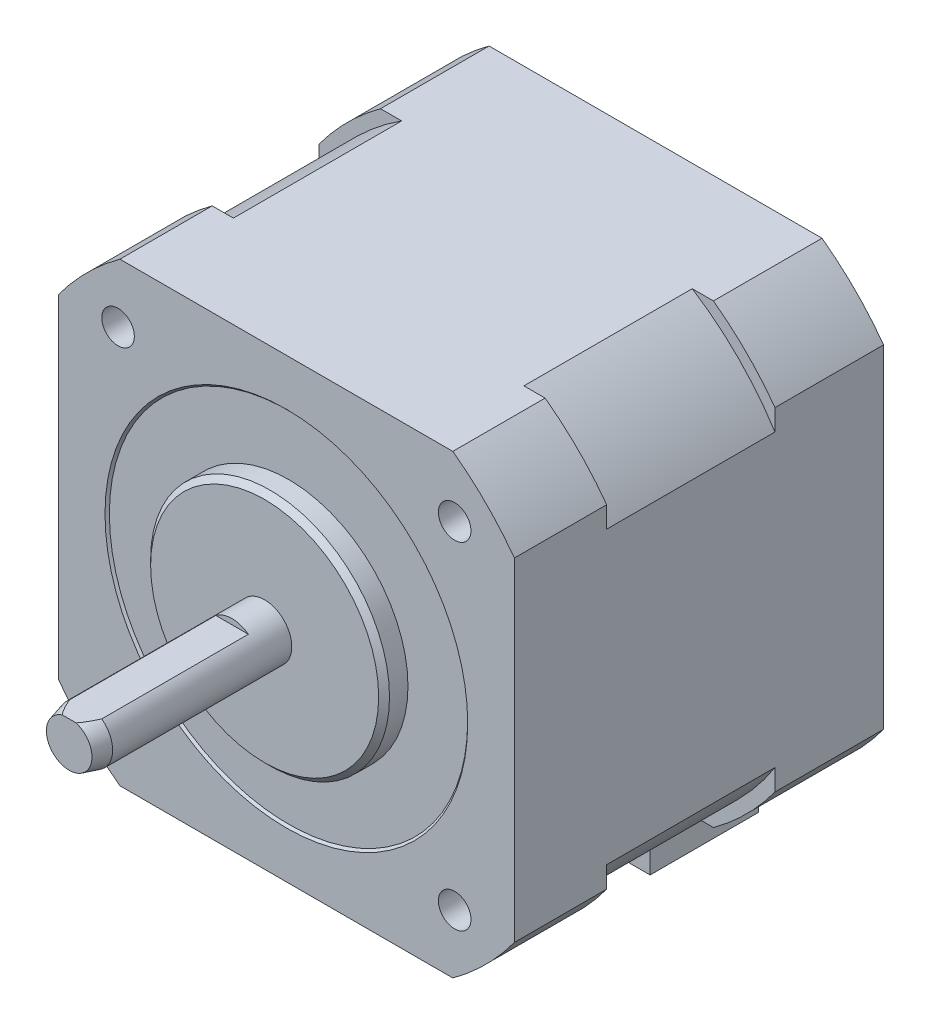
ISO-10303-21;
HEADER;
FILE_DESCRIPTION(('STEP AP214'),'2;1');
FILE_NAME('part.step','',(''),(''),'','','');
FILE_SCHEMA(('AUTOMOTIVE_DESIGN { 1 0 10303 214 1 1 1 1 }'));
ENDSEC;
DATA;
#1=APPLICATION_CONTEXT('core data for automotive mechanical design processes');
#2=APPLICATION_PROTOCOL_DEFINITION('international standard','automotive_design',2000,#1);
#3=PRODUCT_CONTEXT('',#1,'mechanical');
#4=PRODUCT('Part','Part','',(#3));
#5=PRODUCT_RELATED_PRODUCT_CATEGORY('part','',(#4));
#6=PRODUCT_DEFINITION_FORMATION('','',#4);
#7=PRODUCT_DEFINITION_CONTEXT('part definition',#1,'design');
#8=PRODUCT_DEFINITION('design','',#6,#7);
#9=PRODUCT_DEFINITION_SHAPE('','',#8);
#10=(LENGTH_UNIT() NAMED_UNIT(*) SI_UNIT(.MILLI.,.METRE.));
#11=(NAMED_UNIT(*) PLANE_ANGLE_UNIT() SI_UNIT($,.RADIAN.));
#12=(NAMED_UNIT(*) SI_UNIT($,.STERADIAN.) SOLID_ANGLE_UNIT());
#13=UNCERTAINTY_MEASURE_WITH_UNIT(LENGTH_MEASURE(1.E-05),#10,'distance_accuracy_value','');
#14=(GEOMETRIC_REPRESENTATION_CONTEXT(3) GLOBAL_UNCERTAINTY_ASSIGNED_CONTEXT((#13)) GLOBAL_UNIT_ASSIGNED_CONTEXT((#10,
#11,#12)) REPRESENTATION_CONTEXT('',''));
#15=CARTESIAN_POINT('',(0.,0.,0.));
#16=DIRECTION('',(0.,0.,1.));
#17=DIRECTION('',(1.,0.,0.));
#18=AXIS2_PLACEMENT_3D('',#15,#16,#17);
#19=CARTESIAN_POINT('',(21.,-21.,-10.5));
#20=DIRECTION('',(0.,1.,0.));
#21=DIRECTION('',(-1.,0.,0.));
#22=AXIS2_PLACEMENT_3D('',#19,#20,#21);
#23=PLANE('',#22);
#24=DIRECTION('',(0.,0.,-1.));
#25=VECTOR('',#24,1.);
#26=CARTESIAN_POINT('',(-9.5,-21.,-26.));
#27=LINE('',#26,#25);
#28=CARTESIAN_POINT('',(-9.5,-21.,-26.));
#29=VERTEX_POINT('',#28);
#30=CARTESIAN_POINT('',(-9.5,-21.0000000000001,-36.));
#31=VERTEX_POINT('',#30);
#32=EDGE_CURVE('E42',#29,#31,#27,.T.);
#33=ORIENTED_EDGE('',*,*,#32,.F.);
#34=DIRECTION('',(-1.,0.,0.));
#35=VECTOR('',#34,1.);
#36=CARTESIAN_POINT('',(-9.5,-21.,-26.));
#37=LINE('',#36,#35);
#38=CARTESIAN_POINT('',(9.5,-21.,-26.));
#39=VERTEX_POINT('',#38);
#40=EDGE_CURVE('E262',#39,#29,#37,.T.);
#41=ORIENTED_EDGE('',*,*,#40,.F.);
#42=DIRECTION('',(0.,0.,1.));
#43=VECTOR('',#42,1.);
#44=CARTESIAN_POINT('',(9.5,-21.,-26.));
#45=LINE('',#44,#43);
#46=CARTESIAN_POINT('',(9.5,-21.,-36.));
#47=VERTEX_POINT('',#46);
#48=EDGE_CURVE('E278',#47,#39,#45,.T.);
#49=ORIENTED_EDGE('',*,*,#48,.F.);
#50=DIRECTION('',(-1.,0.,0.));
#51=VECTOR('',#50,1.);
#52=CARTESIAN_POINT('',(15.3297097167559,-21.,-36.));
#53=LINE('',#52,#51);
#54=CARTESIAN_POINT('',(15.3297097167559,-21.,-36.));
#55=VERTEX_POINT('',#54);
#56=EDGE_CURVE('E283',#55,#47,#53,.T.);
#57=ORIENTED_EDGE('',*,*,#56,.F.);
#58=DIRECTION('',(0.,0.,1.));
#59=VECTOR('',#58,1.);
#60=CARTESIAN_POINT('',(15.3297097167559,-21.,-36.));
#61=LINE('',#60,#59);
#62=CARTESIAN_POINT('',(15.3297097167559,-21.,-26.));
#63=VERTEX_POINT('',#62);
#64=EDGE_CURVE('E356',#55,#63,#61,.T.);
#65=ORIENTED_EDGE('',*,*,#64,.T.);
#66=DIRECTION('',(-1.,0.,0.));
#67=VECTOR('',#66,1.);
#68=CARTESIAN_POINT('',(-13.3794618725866,-21.,-26.));
#69=LINE('',#68,#67);
#70=CARTESIAN_POINT('',(13.3794618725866,-21.,-26.));
#71=VERTEX_POINT('',#70);
#72=EDGE_CURVE('E317',#63,#71,#69,.T.);
#73=ORIENTED_EDGE('',*,*,#72,.T.);
#74=DIRECTION('',(0.,0.,1.));
#75=VECTOR('',#74,1.);
#76=CARTESIAN_POINT('',(13.3794618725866,-21.,-26.));
#77=LINE('',#76,#75);
#78=CARTESIAN_POINT('',(13.3794618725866,-21.,-10.5));
#79=VERTEX_POINT('',#78);
#80=EDGE_CURVE('E724',#71,#79,#77,.T.);
#81=ORIENTED_EDGE('',*,*,#80,.T.);
#82=DIRECTION('',(-1.,0.,0.));
#83=VECTOR('',#82,1.);
#84=CARTESIAN_POINT('',(21.,-21.,-10.5));
#85=LINE('',#84,#83);
#86=CARTESIAN_POINT('',(15.3297097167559,-21.,-10.5));
#87=VERTEX_POINT('',#86);
#88=EDGE_CURVE('E563',#87,#79,#85,.T.);
#89=ORIENTED_EDGE('',*,*,#88,.F.);
#90=DIRECTION('',(0.,0.,1.));
#91=VECTOR('',#90,1.);
#92=CARTESIAN_POINT('',(15.3297097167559,-21.,-36.));
#93=LINE('',#92,#91);
#94=CARTESIAN_POINT('',(15.3297097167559,-21.,-2.));
#95=VERTEX_POINT('',#94);
#96=EDGE_CURVE('E625',#95,#87,#93,.F.);
#97=ORIENTED_EDGE('',*,*,#96,.F.);
#98=DIRECTION('',(-1.,0.,0.));
#99=VECTOR('',#98,1.);
#100=CARTESIAN_POINT('',(21.,-21.,-2.));
#101=LINE('',#100,#99);
#102=CARTESIAN_POINT('',(-15.3297097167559,-21.,-2.));
#103=VERTEX_POINT('',#102);
#104=EDGE_CURVE('E571',#95,#103,#101,.T.);
#105=ORIENTED_EDGE('',*,*,#104,.T.);
#106=DIRECTION('',(0.,0.,1.));
#107=VECTOR('',#106,1.);
#108=CARTESIAN_POINT('',(-15.3297097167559,-21.,-36.));
#109=LINE('',#108,#107);
#110=CARTESIAN_POINT('',(-15.3297097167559,-21.,-10.5));
#111=VERTEX_POINT('',#110);
#112=EDGE_CURVE('E629',#111,#103,#109,.T.);
#113=ORIENTED_EDGE('',*,*,#112,.F.);
#114=CARTESIAN_POINT('',(-13.3794618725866,-21.,-10.5));
#115=VERTEX_POINT('',#114);
#116=EDGE_CURVE('E568',#115,#111,#85,.T.);
#117=ORIENTED_EDGE('',*,*,#116,.F.);
#118=DIRECTION('',(0.,0.,1.));
#119=VECTOR('',#118,1.);
#120=CARTESIAN_POINT('',(-13.3794618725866,-21.,-26.));
#121=LINE('',#120,#119);
#122=CARTESIAN_POINT('',(-13.3794618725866,-21.,-26.));
#123=VERTEX_POINT('',#122);
#124=EDGE_CURVE('E725',#123,#115,#121,.T.);
#125=ORIENTED_EDGE('',*,*,#124,.F.);
#126=CARTESIAN_POINT('',(-15.3297097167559,-21.,-26.));
#127=VERTEX_POINT('',#126);
#128=EDGE_CURVE('E315',#123,#127,#69,.T.);
#129=ORIENTED_EDGE('',*,*,#128,.T.);
#130=DIRECTION('',(0.,0.,1.));
#131=VECTOR('',#130,1.);
#132=CARTESIAN_POINT('',(-15.3297097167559,-21.,-36.));
#133=LINE('',#132,#131);
#134=CARTESIAN_POINT('',(-15.3297097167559,-21.,-36.));
#135=VERTEX_POINT('',#134);
#136=EDGE_CURVE('E353',#135,#127,#133,.T.);
#137=ORIENTED_EDGE('',*,*,#136,.F.);
#138=EDGE_CURVE('E60',#31,#135,#53,.T.);
#139=ORIENTED_EDGE('',*,*,#138,.F.);
#140=EDGE_LOOP('',(#33,#41,#49,#57,#65,#73,#81,#89,#97,#105,#113,#117,#125,#129,#137,#139));
#141=FACE_BOUND('',#140,.T.);
#142=ADVANCED_FACE('F38',(#141),#23,.F.);
#143=CARTESIAN_POINT('',(0.,0.,18.));
#144=DIRECTION('',(0.,0.,-1.));
#145=DIRECTION('',(-1.,0.,0.));
#146=AXIS2_PLACEMENT_3D('',#143,#144,#145);
#147=CYLINDRICAL_SURFACE('',#146,2.5);
#148=CARTESIAN_POINT('',(0.,0.,16.4999999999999));
#149=DIRECTION('',(0.,0.,1.));
#150=DIRECTION('',(1.,0.,0.));
#151=AXIS2_PLACEMENT_3D('',#148,#149,#150);
#152=CIRCLE('',#151,2.5);
#153=CARTESIAN_POINT('',(1.5,2.,16.4999999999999));
#154=VERTEX_POINT('',#153);
#155=CARTESIAN_POINT('',(-1.49999999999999,2.,16.4999999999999));
#156=VERTEX_POINT('',#155);
#157=EDGE_CURVE('E407',#154,#156,#152,.F.);
#158=ORIENTED_EDGE('',*,*,#157,.T.);
#159=DIRECTION('',(0.,0.,-1.));
#160=VECTOR('',#159,1.);
#161=CARTESIAN_POINT('',(-1.5,2.,18.));
#162=LINE('',#161,#160);
#163=CARTESIAN_POINT('',(-1.5,2.,3.));
#164=VERTEX_POINT('',#163);
#165=EDGE_CURVE('E303',#156,#164,#162,.T.);
#166=ORIENTED_EDGE('',*,*,#165,.T.);
#167=CARTESIAN_POINT('',(0.,0.,3.));
#168=DIRECTION('',(0.,0.,1.));
#169=DIRECTION('',(1.,0.,0.));
#170=AXIS2_PLACEMENT_3D('',#167,#168,#169);
#171=CIRCLE('',#170,2.5);
#172=CARTESIAN_POINT('',(1.5,2.,3.));
#173=VERTEX_POINT('',#172);
#174=EDGE_CURVE('E419',#173,#164,#171,.T.);
#175=ORIENTED_EDGE('',*,*,#174,.F.);
#176=DIRECTION('',(0.,0.,-1.));
#177=VECTOR('',#176,1.);
#178=CARTESIAN_POINT('',(1.5,2.,18.));
#179=LINE('',#178,#177);
#180=EDGE_CURVE('E756',#173,#154,#179,.F.);
#181=ORIENTED_EDGE('',*,*,#180,.T.);
#182=EDGE_LOOP('',(#158,#166,#175,#181));
#183=FACE_BOUND('',#182,.T.);
#184=CARTESIAN_POINT('',(0.,0.,0.));
#185=DIRECTION('',(0.,0.,-1.));
#186=DIRECTION('',(-1.,0.,0.));
#187=AXIS2_PLACEMENT_3D('',#184,#185,#186);
#188=CIRCLE('',#187,2.5);
#189=CARTESIAN_POINT('',(-2.5,0.,0.));
#190=VERTEX_POINT('',#189);
#191=EDGE_CURVE('E560',#190,#190,#188,.T.);
#192=ORIENTED_EDGE('',*,*,#191,.F.);
#193=EDGE_LOOP('',(#192));
#194=FACE_BOUND('',#193,.T.);
#195=ADVANCED_FACE('F528',(#183,#194),#147,.T.);
#196=CARTESIAN_POINT('',(0.,0.,18.));
#197=DIRECTION('',(0.,0.,1.));
#198=DIRECTION('',(1.,0.,0.));
#199=AXIS2_PLACEMENT_3D('',#196,#197,#198);
#200=PLANE('',#199);
#201=DIRECTION('',(1.,0.,0.));
#202=VECTOR('',#201,1.);
#203=CARTESIAN_POINT('',(-4.72781232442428,2.,18.));
#204=LINE('',#203,#202);
#205=CARTESIAN_POINT('',(-0.633974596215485,2.,18.));
#206=VERTEX_POINT('',#205);
#207=CARTESIAN_POINT('',(0.633974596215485,2.,18.));
#208=VERTEX_POINT('',#207);
#209=EDGE_CURVE('E759',#206,#208,#204,.T.);
#210=ORIENTED_EDGE('',*,*,#209,.F.);
#211=CARTESIAN_POINT('',(0.,0.,18.));
#212=DIRECTION('',(0.,0.,1.));
#213=DIRECTION('',(1.,0.,0.));
#214=AXIS2_PLACEMENT_3D('',#211,#212,#213);
#215=CIRCLE('',#214,2.09807621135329);
#216=EDGE_CURVE('E404',#206,#208,#215,.T.);
#217=ORIENTED_EDGE('',*,*,#216,.T.);
#218=EDGE_LOOP('',(#210,#217));
#219=FACE_BOUND('',#218,.T.);
#220=ADVANCED_FACE('F543',(#219),#200,.T.);
#221=CARTESIAN_POINT('',(0.,0.,0.));
#222=DIRECTION('',(0.,0.,-1.));
#223=DIRECTION('',(-1.,0.,0.));
#224=AXIS2_PLACEMENT_3D('',#221,#222,#223);
#225=PLANE('',#224);
#226=CARTESIAN_POINT('',(0.,0.,0.));
#227=DIRECTION('',(0.,0.,-1.));
#228=DIRECTION('',(-1.,0.,0.));
#229=AXIS2_PLACEMENT_3D('',#226,#227,#228);
#230=CIRCLE('',#229,10.5);
#231=CARTESIAN_POINT('',(-10.5,0.,0.));
#232=VERTEX_POINT('',#231);
#233=EDGE_CURVE('E48',#232,#232,#230,.F.);
#234=ORIENTED_EDGE('',*,*,#233,.T.);
#235=EDGE_LOOP('',(#234));
#236=FACE_BOUND('',#235,.T.);
#237=ORIENTED_EDGE('',*,*,#191,.T.);
#238=EDGE_LOOP('',(#237));
#239=FACE_BOUND('',#238,.T.);
#240=ADVANCED_FACE('F539',(#236,#239),#225,.F.);
#241=CARTESIAN_POINT('',(0.,0.,-2.));
#242=DIRECTION('',(0.,0.,1.));
#243=DIRECTION('',(1.,0.,0.));
#244=AXIS2_PLACEMENT_3D('',#241,#242,#243);
#245=CYLINDRICAL_SURFACE('',#244,11.);
#246=CARTESIAN_POINT('',(0.,0.,-0.500000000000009));
#247=DIRECTION('',(0.,0.,-1.));
#248=DIRECTION('',(-1.,0.,0.));
#249=AXIS2_PLACEMENT_3D('',#246,#247,#248);
#250=CIRCLE('',#249,11.);
#251=CARTESIAN_POINT('',(-11.,0.,-0.500000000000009));
#252=VERTEX_POINT('',#251);
#253=EDGE_CURVE('E825',#252,#252,#250,.T.);
#254=ORIENTED_EDGE('',*,*,#253,.T.);
#255=EDGE_LOOP('',(#254));
#256=FACE_BOUND('',#255,.T.);
#257=CARTESIAN_POINT('',(0.,0.,-2.2));
#258=DIRECTION('',(0.,0.,1.));
#259=DIRECTION('',(1.,0.,0.));
#260=AXIS2_PLACEMENT_3D('',#257,#258,#259);
#261=CIRCLE('',#260,11.);
#262=CARTESIAN_POINT('',(11.,0.,-2.2));
#263=VERTEX_POINT('',#262);
#264=EDGE_CURVE('E265',#263,#263,#261,.T.);
#265=ORIENTED_EDGE('',*,*,#264,.T.);
#266=EDGE_LOOP('',(#265));
#267=FACE_BOUND('',#266,.T.);
#268=ADVANCED_FACE('F542',(#256,#267),#245,.T.);
#269=CARTESIAN_POINT('',(0.,0.,18.));
#270=DIRECTION('',(0.,0.,-1.));
#271=DIRECTION('',(-1.,0.,0.));
#272=AXIS2_PLACEMENT_3D('',#269,#270,#271);
#273=CONICAL_SURFACE('',#272,2.09807621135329,0.261799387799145);
#274=CARTESIAN_POINT('',(-2.67411513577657,2.,13.3677080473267));
#275=CARTESIAN_POINT('',(-2.63311786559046,2.,13.4902257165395));
#276=CARTESIAN_POINT('',(-2.59182160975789,2.,13.6126436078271));
#277=CARTESIAN_POINT('',(-2.50853023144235,2.,13.8572444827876));
#278=CARTESIAN_POINT('',(-2.46653509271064,2.,13.9794274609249));
#279=CARTESIAN_POINT('',(-2.33928264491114,2.,14.34576464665));
#280=CARTESIAN_POINT('',(-2.25282589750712,2.,14.5895039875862));
#281=CARTESIAN_POINT('',(-2.07457613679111,2.,15.0781045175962));
#282=CARTESIAN_POINT('',(-1.98273458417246,2.,15.3229481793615));
#283=CARTESIAN_POINT('',(-1.84011140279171,2.,15.688262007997));
#284=CARTESIAN_POINT('',(-1.79177038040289,2.,15.8096838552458));
#285=CARTESIAN_POINT('',(-1.6930545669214,2.,16.0516959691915));
#286=CARTESIAN_POINT('',(-1.64267985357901,2.,16.1722862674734));
#287=CARTESIAN_POINT('',(-1.53950262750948,2.,16.4120087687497));
#288=CARTESIAN_POINT('',(-1.4867076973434,2.,16.5311442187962));
#289=CARTESIAN_POINT('',(-1.37773401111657,2.,16.7679408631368));
#290=CARTESIAN_POINT('',(-1.32155357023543,2.,16.8856012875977));
#291=CARTESIAN_POINT('',(-1.20458285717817,2.,17.1187131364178));
#292=CARTESIAN_POINT('',(-1.14379017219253,2.,17.2341633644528));
#293=CARTESIAN_POINT('',(-1.01570284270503,2.,17.4612984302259));
#294=CARTESIAN_POINT('',(-0.948415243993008,2.,17.5729871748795));
#295=CARTESIAN_POINT('',(-0.817363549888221,2.,17.7692701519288));
#296=CARTESIAN_POINT('',(-0.755348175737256,2.,17.8549879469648));
#297=CARTESIAN_POINT('',(-0.654778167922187,2.,17.9770588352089));
#298=CARTESIAN_POINT('',(-0.620094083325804,2.,18.0165731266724));
#299=CARTESIAN_POINT('',(-0.547506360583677,2.,18.092493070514));
#300=CARTESIAN_POINT('',(-0.509607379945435,2.,18.1289030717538));
#301=CARTESIAN_POINT('',(-0.439829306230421,2.,18.1884315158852));
#302=CARTESIAN_POINT('',(-0.408844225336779,2.,18.212585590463));
#303=CARTESIAN_POINT('',(-0.344218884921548,2.,18.2572111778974));
#304=CARTESIAN_POINT('',(-0.310575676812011,2.,18.2776785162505));
#305=CARTESIAN_POINT('',(-0.240012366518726,2.,18.3136158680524));
#306=CARTESIAN_POINT('',(-0.203051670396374,2.,18.3290087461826));
#307=CARTESIAN_POINT('',(-0.126881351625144,2.,18.3523462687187));
#308=CARTESIAN_POINT('',(-0.0876800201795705,2.,18.3603166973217));
#309=CARTESIAN_POINT('',(-0.0127311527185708,2.,18.367039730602));
#310=CARTESIAN_POINT('',(0.0229341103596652,2.,18.3666919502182));
#311=CARTESIAN_POINT('',(0.0935290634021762,2.,18.3590326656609));
#312=CARTESIAN_POINT('',(0.12845758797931,2.,18.3517108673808));
#313=CARTESIAN_POINT('',(0.201815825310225,2.,18.329553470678));
#314=CARTESIAN_POINT('',(0.239935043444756,2.,18.3137192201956));
#315=CARTESIAN_POINT('',(0.313185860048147,2.,18.276283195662));
#316=CARTESIAN_POINT('',(0.348311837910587,2.,18.2546708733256));
#317=CARTESIAN_POINT('',(0.443923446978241,2.,18.1877621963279));
#318=CARTESIAN_POINT('',(0.501075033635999,2.,18.1377652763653));
#319=CARTESIAN_POINT('',(0.581429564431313,2.,18.0575943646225));
#320=CARTESIAN_POINT('',(0.607372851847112,2.,18.0299378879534));
#321=CARTESIAN_POINT('',(0.657731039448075,2.,17.9732675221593));
#322=CARTESIAN_POINT('',(0.682146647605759,2.,17.9442542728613));
#323=CARTESIAN_POINT('',(0.749893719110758,2.,17.8601101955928));
#324=CARTESIAN_POINT('',(0.791668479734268,2.,17.8037362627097));
#325=CARTESIAN_POINT('',(0.871939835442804,2.,17.6886841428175));
#326=CARTESIAN_POINT('',(0.910434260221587,2.,17.6300044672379));
#327=CARTESIAN_POINT('',(0.984949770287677,2.,17.5109259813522));
#328=CARTESIAN_POINT('',(1.02096523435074,2.,17.4505236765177));
#329=CARTESIAN_POINT('',(1.09096213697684,2.,17.3285472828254));
#330=CARTESIAN_POINT('',(1.12494324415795,2.,17.2669730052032));
#331=CARTESIAN_POINT('',(1.2249539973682,2.,17.0799665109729));
#332=CARTESIAN_POINT('',(1.28847862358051,2.,16.9531970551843));
#333=CARTESIAN_POINT('',(1.41085483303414,2.,16.6976781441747));
#334=CARTESIAN_POINT('',(1.46971282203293,2.,16.5689317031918));
#335=CARTESIAN_POINT('',(1.58310001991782,2.,16.3121463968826));
#336=CARTESIAN_POINT('',(1.63768554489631,2.,16.1841322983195));
#337=CARTESIAN_POINT('',(1.74436311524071,2.,15.9270663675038));
#338=CARTESIAN_POINT('',(1.79645500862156,2.,15.7980144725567));
#339=CARTESIAN_POINT('',(1.94989108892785,2.,15.4094944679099));
#340=CARTESIAN_POINT('',(2.04830566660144,2.,15.1488712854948));
#341=CARTESIAN_POINT('',(2.23648040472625,2.,14.6352664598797));
#342=CARTESIAN_POINT('',(2.32642514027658,2.,14.3823515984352));
#343=CARTESIAN_POINT('',(2.45867006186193,2.,14.0022493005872));
#344=CARTESIAN_POINT('',(2.50227709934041,2.,13.8755147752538));
#345=CARTESIAN_POINT('',(2.58873482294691,2.,13.6217918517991));
#346=CARTESIAN_POINT('',(2.63158553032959,2.,13.4948034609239));
#347=CARTESIAN_POINT('',(2.67411513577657,2.,13.3677080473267));
#348=B_SPLINE_CURVE_WITH_KNOTS('',3,(#274,#275,#276,#277,#278,#279,#280,#281,#282,#283,#284,
#285,#286,#287,#288,#289,#290,#291,#292,#293,#294,#295,#296,#297,#298,#299,#300,#301,#302,#303,
#304,#305,#306,#307,#308,#309,#310,#311,#312,#313,#314,#315,#316,#317,#318,#319,#320,#321,#322,
#323,#324,#325,#326,#327,#328,#329,#330,#331,#332,#333,#334,#335,#336,#337,#338,#339,#340,#341,
#342,#343,#344,#345,#346,#347),.UNSPECIFIED.,.F.,.F.,(4,2,2,2,2,2,2,2,2,2,2,2,2,2,2,2,2,2,2,2,2,
2,2,2,2,2,2,2,2,2,2,2,2,2,2,2,4),(0.,0.38758488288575,0.775178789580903,1.5510087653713,
2.33544116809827,2.72750017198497,3.11954420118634,3.51043426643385,3.90152049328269,
4.2928127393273,4.68368517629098,5.00048531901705,5.15809093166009,5.31547199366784,
5.4331414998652,5.55094341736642,5.67046127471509,5.78956238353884,5.89584731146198,
6.00228936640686,6.12543181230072,6.24880061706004,6.47525140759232,6.58900607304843,
6.70270762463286,6.91302983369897,7.12349013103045,7.33441292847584,7.54536999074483,
7.97059745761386,8.39523074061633,8.81269313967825,9.23018095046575,10.0658395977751,
10.8711084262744,11.2731870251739,11.675254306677),.UNSPECIFIED.);
#349=EDGE_CURVE('E418',#156,#206,#348,.T.);
#350=ORIENTED_EDGE('',*,*,#349,.F.);
#351=ORIENTED_EDGE('',*,*,#157,.F.);
#352=EDGE_CURVE('E411',#208,#154,#348,.T.);
#353=ORIENTED_EDGE('',*,*,#352,.F.);
#354=ORIENTED_EDGE('',*,*,#216,.F.);
#355=EDGE_LOOP('',(#350,#351,#353,#354));
#356=FACE_BOUND('',#355,.T.);
#357=ADVANCED_FACE('F421',(#356),#273,.T.);
#358=CARTESIAN_POINT('',(0.,0.,3.));
#359=DIRECTION('',(0.,0.,1.));
#360=DIRECTION('',(1.,0.,0.));
#361=AXIS2_PLACEMENT_3D('',#358,#359,#360);
#362=PLANE('',#361);
#363=ORIENTED_EDGE('',*,*,#174,.T.);
#364=DIRECTION('',(1.,0.,0.));
#365=VECTOR('',#364,1.);
#366=CARTESIAN_POINT('',(-4.72781232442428,2.,3.));
#367=LINE('',#366,#365);
#368=EDGE_CURVE('E758',#164,#173,#367,.T.);
#369=ORIENTED_EDGE('',*,*,#368,.T.);
#370=EDGE_LOOP('',(#363,#369));
#371=FACE_BOUND('',#370,.T.);
#372=ADVANCED_FACE('F430',(#371),#362,.T.);
#373=CARTESIAN_POINT('',(-4.72781232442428,2.,3.));
#374=DIRECTION('',(0.,-1.,0.));
#375=DIRECTION('',(0.,0.,-1.));
#376=AXIS2_PLACEMENT_3D('',#373,#374,#375);
#377=PLANE('',#376);
#378=ORIENTED_EDGE('',*,*,#349,.T.);
#379=ORIENTED_EDGE('',*,*,#209,.T.);
#380=ORIENTED_EDGE('',*,*,#352,.T.);
#381=ORIENTED_EDGE('',*,*,#180,.F.);
#382=ORIENTED_EDGE('',*,*,#368,.F.);
#383=ORIENTED_EDGE('',*,*,#165,.F.);
#384=EDGE_LOOP('',(#378,#379,#380,#381,#382,#383));
#385=FACE_BOUND('',#384,.T.);
#386=ADVANCED_FACE('F424',(#385),#377,.F.);
#387=CARTESIAN_POINT('',(0.,0.,-2.2));
#388=DIRECTION('',(0.,0.,1.));
#389=DIRECTION('',(1.,0.,0.));
#390=AXIS2_PLACEMENT_3D('',#387,#388,#389);
#391=PLANE('',#390);
#392=ORIENTED_EDGE('',*,*,#264,.F.);
#393=EDGE_LOOP('',(#392));
#394=FACE_BOUND('',#393,.T.);
#395=CARTESIAN_POINT('',(0.,0.,-2.2));
#396=DIRECTION('',(0.,0.,1.));
#397=DIRECTION('',(1.,0.,0.));
#398=AXIS2_PLACEMENT_3D('',#395,#396,#397);
#399=CIRCLE('',#398,16.5);
#400=CARTESIAN_POINT('',(16.5,0.,-2.2));
#401=VERTEX_POINT('',#400);
#402=EDGE_CURVE('E268',#401,#401,#399,.T.);
#403=ORIENTED_EDGE('',*,*,#402,.T.);
#404=EDGE_LOOP('',(#403));
#405=FACE_BOUND('',#404,.T.);
#406=ADVANCED_FACE('F429',(#394,#405),#391,.T.);
#407=CARTESIAN_POINT('',(-21.,-21.,-10.5));
#408=DIRECTION('',(0.,0.,-1.));
#409=DIRECTION('',(-1.,0.,0.));
#410=AXIS2_PLACEMENT_3D('',#407,#408,#409);
#411=PLANE('',#410);
#412=CARTESIAN_POINT('',(0.,0.,-10.5));
#413=DIRECTION('',(0.,0.,-1.));
#414=DIRECTION('',(-1.,0.,0.));
#415=AXIS2_PLACEMENT_3D('',#412,#413,#414);
#416=CIRCLE('',#415,24.9);
#417=CARTESIAN_POINT('',(13.3794618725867,21.,-10.5));
#418=VERTEX_POINT('',#417);
#419=CARTESIAN_POINT('',(21.,13.3794618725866,-10.5));
#420=VERTEX_POINT('',#419);
#421=EDGE_CURVE('E402',#418,#420,#416,.T.);
#422=ORIENTED_EDGE('',*,*,#421,.F.);
#423=DIRECTION('',(1.,0.,0.));
#424=VECTOR('',#423,1.);
#425=CARTESIAN_POINT('',(21.,21.,-10.5));
#426=LINE('',#425,#424);
#427=CARTESIAN_POINT('',(15.3297097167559,21.,-10.5));
#428=VERTEX_POINT('',#427);
#429=EDGE_CURVE('E577',#418,#428,#426,.T.);
#430=ORIENTED_EDGE('',*,*,#429,.T.);
#431=CARTESIAN_POINT('',(0.,0.,-10.5));
#432=DIRECTION('',(0.,0.,-1.));
#433=DIRECTION('',(-1.,0.,0.));
#434=AXIS2_PLACEMENT_3D('',#431,#432,#433);
#435=CIRCLE('',#434,26.);
#436=CARTESIAN_POINT('',(21.,15.3297097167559,-10.5));
#437=VERTEX_POINT('',#436);
#438=EDGE_CURVE('E605',#428,#437,#435,.T.);
#439=ORIENTED_EDGE('',*,*,#438,.T.);
#440=DIRECTION('',(0.,-1.,0.));
#441=VECTOR('',#440,1.);
#442=CARTESIAN_POINT('',(21.,21.,-10.5));
#443=LINE('',#442,#441);
#444=EDGE_CURVE('E599',#437,#420,#443,.T.);
#445=ORIENTED_EDGE('',*,*,#444,.T.);
#446=EDGE_LOOP('',(#422,#430,#439,#445));
#447=FACE_BOUND('',#446,.T.);
#448=ADVANCED_FACE('F500',(#447),#411,.T.);
#449=CARTESIAN_POINT('',(0.,0.,-26.));
#450=DIRECTION('',(0.,0.,1.));
#451=DIRECTION('',(1.,0.,0.));
#452=AXIS2_PLACEMENT_3D('',#449,#450,#451);
#453=CYLINDRICAL_SURFACE('',#452,24.9);
#454=ORIENTED_EDGE('',*,*,#421,.T.);
#455=DIRECTION('',(0.,0.,1.));
#456=VECTOR('',#455,1.);
#457=CARTESIAN_POINT('',(21.,13.3794618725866,-26.));
#458=LINE('',#457,#456);
#459=CARTESIAN_POINT('',(21.0000000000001,13.3794618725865,-26.));
#460=VERTEX_POINT('',#459);
#461=EDGE_CURVE('E645',#460,#420,#458,.T.);
#462=ORIENTED_EDGE('',*,*,#461,.F.);
#463=CARTESIAN_POINT('',(0.,0.,-26.));
#464=DIRECTION('',(0.,0.,-1.));
#465=DIRECTION('',(-1.,0.,0.));
#466=AXIS2_PLACEMENT_3D('',#463,#464,#465);
#467=CIRCLE('',#466,24.9);
#468=CARTESIAN_POINT('',(13.3794618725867,21.,-26.));
#469=VERTEX_POINT('',#468);
#470=EDGE_CURVE('E668',#469,#460,#467,.T.);
#471=ORIENTED_EDGE('',*,*,#470,.F.);
#472=DIRECTION('',(0.,0.,1.));
#473=VECTOR('',#472,1.);
#474=CARTESIAN_POINT('',(13.3794618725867,21.,-26.));
#475=LINE('',#474,#473);
#476=EDGE_CURVE('E648',#469,#418,#475,.T.);
#477=ORIENTED_EDGE('',*,*,#476,.T.);
#478=EDGE_LOOP('',(#454,#462,#471,#477));
#479=FACE_BOUND('',#478,.T.);
#480=ADVANCED_FACE('F497',(#479),#453,.T.);
#481=CARTESIAN_POINT('',(0.,0.,-26.));
#482=DIRECTION('',(0.,0.,-1.));
#483=DIRECTION('',(-1.,0.,0.));
#484=AXIS2_PLACEMENT_3D('',#481,#482,#483);
#485=PLANE('',#484);
#486=DIRECTION('',(1.,0.,0.));
#487=VECTOR('',#486,1.);
#488=CARTESIAN_POINT('',(13.3794618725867,21.,-26.));
#489=LINE('',#488,#487);
#490=CARTESIAN_POINT('',(15.3297097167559,21.,-26.));
#491=VERTEX_POINT('',#490);
#492=EDGE_CURVE('E335',#469,#491,#489,.T.);
#493=ORIENTED_EDGE('',*,*,#492,.F.);
#494=ORIENTED_EDGE('',*,*,#470,.T.);
#495=DIRECTION('',(0.,-1.,0.));
#496=VECTOR('',#495,1.);
#497=CARTESIAN_POINT('',(21.,-13.3794618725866,-26.));
#498=LINE('',#497,#496);
#499=CARTESIAN_POINT('',(21.,15.3297097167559,-26.));
#500=VERTEX_POINT('',#499);
#501=EDGE_CURVE('E312',#500,#460,#498,.T.);
#502=ORIENTED_EDGE('',*,*,#501,.F.);
#503=CARTESIAN_POINT('',(0.,0.,-26.));
#504=DIRECTION('',(0.,0.,-1.));
#505=DIRECTION('',(-1.,0.,0.));
#506=AXIS2_PLACEMENT_3D('',#503,#504,#505);
#507=CIRCLE('',#506,26.);
#508=EDGE_CURVE('E299',#491,#500,#507,.T.);
#509=ORIENTED_EDGE('',*,*,#508,.F.);
#510=EDGE_LOOP('',(#493,#494,#502,#509));
#511=FACE_BOUND('',#510,.T.);
#512=ADVANCED_FACE('F444',(#511),#485,.F.);
#513=CARTESIAN_POINT('',(0.,0.,-36.));
#514=DIRECTION('',(0.,0.,1.));
#515=DIRECTION('',(1.,0.,0.));
#516=AXIS2_PLACEMENT_3D('',#513,#514,#515);
#517=CYLINDRICAL_SURFACE('',#516,26.);
#518=ORIENTED_EDGE('',*,*,#508,.T.);
#519=DIRECTION('',(0.,0.,1.));
#520=VECTOR('',#519,1.);
#521=CARTESIAN_POINT('',(21.,15.3297097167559,-36.));
#522=LINE('',#521,#520);
#523=CARTESIAN_POINT('',(21.,15.3297097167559,-36.));
#524=VERTEX_POINT('',#523);
#525=EDGE_CURVE('E361',#524,#500,#522,.T.);
#526=ORIENTED_EDGE('',*,*,#525,.F.);
#527=CARTESIAN_POINT('',(0.,0.,-36.));
#528=DIRECTION('',(0.,0.,-1.));
#529=DIRECTION('',(-1.,0.,0.));
#530=AXIS2_PLACEMENT_3D('',#527,#528,#529);
#531=CIRCLE('',#530,26.);
#532=CARTESIAN_POINT('',(15.3297097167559,21.,-36.));
#533=VERTEX_POINT('',#532);
#534=EDGE_CURVE('E750',#533,#524,#531,.T.);
#535=ORIENTED_EDGE('',*,*,#534,.F.);
#536=DIRECTION('',(0.,0.,1.));
#537=VECTOR('',#536,1.);
#538=CARTESIAN_POINT('',(15.3297097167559,21.,-36.));
#539=LINE('',#538,#537);
#540=EDGE_CURVE('E298',#533,#491,#539,.T.);
#541=ORIENTED_EDGE('',*,*,#540,.T.);
#542=EDGE_LOOP('',(#518,#526,#535,#541));
#543=FACE_BOUND('',#542,.T.);
#544=ADVANCED_FACE('F456',(#543),#517,.T.);
#545=CARTESIAN_POINT('',(0.,0.,-10.5));
#546=DIRECTION('',(0.,0.,-1.));
#547=DIRECTION('',(-1.,0.,0.));
#548=AXIS2_PLACEMENT_3D('',#545,#546,#547);
#549=CIRCLE('',#548,24.9);
#550=CARTESIAN_POINT('',(21.,-13.3794618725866,-10.5));
#551=VERTEX_POINT('',#550);
#552=EDGE_CURVE('E389',#551,#79,#549,.T.);
#553=ORIENTED_EDGE('',*,*,#552,.F.);
#554=CARTESIAN_POINT('',(21.,-15.3297097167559,-10.5));
#555=VERTEX_POINT('',#554);
#556=EDGE_CURVE('E594',#551,#555,#443,.T.);
#557=ORIENTED_EDGE('',*,*,#556,.T.);
#558=EDGE_CURVE('E566',#555,#87,#435,.T.);
#559=ORIENTED_EDGE('',*,*,#558,.T.);
#560=ORIENTED_EDGE('',*,*,#88,.T.);
#561=EDGE_LOOP('',(#553,#557,#559,#560));
#562=FACE_BOUND('',#561,.T.);
#563=ADVANCED_FACE('F459',(#562),#411,.T.);
#564=CARTESIAN_POINT('',(0.,0.,-26.));
#565=DIRECTION('',(0.,0.,1.));
#566=DIRECTION('',(1.,0.,0.));
#567=AXIS2_PLACEMENT_3D('',#564,#565,#566);
#568=CYLINDRICAL_SURFACE('',#567,24.9);
#569=ORIENTED_EDGE('',*,*,#552,.T.);
#570=ORIENTED_EDGE('',*,*,#80,.F.);
#571=CARTESIAN_POINT('',(0.,0.,-26.));
#572=DIRECTION('',(0.,0.,-1.));
#573=DIRECTION('',(-1.,0.,0.));
#574=AXIS2_PLACEMENT_3D('',#571,#572,#573);
#575=CIRCLE('',#574,24.9);
#576=CARTESIAN_POINT('',(21.,-13.3794618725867,-26.));
#577=VERTEX_POINT('',#576);
#578=EDGE_CURVE('E397',#577,#71,#575,.T.);
#579=ORIENTED_EDGE('',*,*,#578,.F.);
#580=DIRECTION('',(0.,0.,1.));
#581=VECTOR('',#580,1.);
#582=CARTESIAN_POINT('',(21.,-13.3794618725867,-26.));
#583=LINE('',#582,#581);
#584=EDGE_CURVE('E649',#577,#551,#583,.T.);
#585=ORIENTED_EDGE('',*,*,#584,.T.);
#586=EDGE_LOOP('',(#569,#570,#579,#585));
#587=FACE_BOUND('',#586,.T.);
#588=ADVANCED_FACE('F441',(#587),#568,.T.);
#589=CARTESIAN_POINT('',(21.,-15.3297097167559,-26.));
#590=VERTEX_POINT('',#589);
#591=EDGE_CURVE('E302',#577,#590,#498,.T.);
#592=ORIENTED_EDGE('',*,*,#591,.F.);
#593=ORIENTED_EDGE('',*,*,#578,.T.);
#594=ORIENTED_EDGE('',*,*,#72,.F.);
#595=CARTESIAN_POINT('',(0.,0.,-26.));
#596=DIRECTION('',(0.,0.,-1.));
#597=DIRECTION('',(-1.,0.,0.));
#598=AXIS2_PLACEMENT_3D('',#595,#596,#597);
#599=CIRCLE('',#598,26.);
#600=EDGE_CURVE('E306',#590,#63,#599,.T.);
#601=ORIENTED_EDGE('',*,*,#600,.F.);
#602=EDGE_LOOP('',(#592,#593,#594,#601));
#603=FACE_BOUND('',#602,.T.);
#604=ADVANCED_FACE('F437',(#603),#485,.F.);
#605=CARTESIAN_POINT('',(0.,0.,-36.));
#606=DIRECTION('',(0.,0.,1.));
#607=DIRECTION('',(1.,0.,0.));
#608=AXIS2_PLACEMENT_3D('',#605,#606,#607);
#609=CYLINDRICAL_SURFACE('',#608,26.);
#610=ORIENTED_EDGE('',*,*,#600,.T.);
#611=ORIENTED_EDGE('',*,*,#64,.F.);
#612=CARTESIAN_POINT('',(0.,0.,-36.));
#613=DIRECTION('',(0.,0.,-1.));
#614=DIRECTION('',(-1.,0.,0.));
#615=AXIS2_PLACEMENT_3D('',#612,#613,#614);
#616=CIRCLE('',#615,26.);
#617=CARTESIAN_POINT('',(21.,-15.3297097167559,-36.));
#618=VERTEX_POINT('',#617);
#619=EDGE_CURVE('E284',#618,#55,#616,.T.);
#620=ORIENTED_EDGE('',*,*,#619,.F.);
#621=DIRECTION('',(0.,0.,1.));
#622=VECTOR('',#621,1.);
#623=CARTESIAN_POINT('',(21.,-15.3297097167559,-36.));
#624=LINE('',#623,#622);
#625=EDGE_CURVE('E359',#618,#590,#624,.T.);
#626=ORIENTED_EDGE('',*,*,#625,.T.);
#627=EDGE_LOOP('',(#610,#611,#620,#626));
#628=FACE_BOUND('',#627,.T.);
#629=ADVANCED_FACE('F440',(#628),#609,.T.);
#630=CARTESIAN_POINT('',(0.,0.,-10.5));
#631=DIRECTION('',(0.,0.,-1.));
#632=DIRECTION('',(-1.,0.,0.));
#633=AXIS2_PLACEMENT_3D('',#630,#631,#632);
#634=CIRCLE('',#633,24.9);
#635=CARTESIAN_POINT('',(-21.,-13.3794618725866,-10.5));
#636=VERTEX_POINT('',#635);
#637=EDGE_CURVE('E657',#115,#636,#634,.T.);
#638=ORIENTED_EDGE('',*,*,#637,.F.);
#639=ORIENTED_EDGE('',*,*,#116,.T.);
#640=CARTESIAN_POINT('',(-21.,-15.3297097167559,-10.5));
#641=VERTEX_POINT('',#640);
#642=EDGE_CURVE('E562',#111,#641,#435,.T.);
#643=ORIENTED_EDGE('',*,*,#642,.T.);
#644=DIRECTION('',(0.,1.,0.));
#645=VECTOR('',#644,1.);
#646=CARTESIAN_POINT('',(-21.,21.,-10.5));
#647=LINE('',#646,#645);
#648=EDGE_CURVE('E574',#641,#636,#647,.T.);
#649=ORIENTED_EDGE('',*,*,#648,.T.);
#650=EDGE_LOOP('',(#638,#639,#643,#649));
#651=FACE_BOUND('',#650,.T.);
#652=ADVANCED_FACE('F454',(#651),#411,.T.);
#653=CARTESIAN_POINT('',(0.,0.,-26.));
#654=DIRECTION('',(0.,0.,1.));
#655=DIRECTION('',(1.,0.,0.));
#656=AXIS2_PLACEMENT_3D('',#653,#654,#655);
#657=CYLINDRICAL_SURFACE('',#656,24.9);
#658=ORIENTED_EDGE('',*,*,#637,.T.);
#659=DIRECTION('',(0.,0.,1.));
#660=VECTOR('',#659,1.);
#661=CARTESIAN_POINT('',(-21.,-13.3794618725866,-26.));
#662=LINE('',#661,#660);
#663=CARTESIAN_POINT('',(-21.,-13.3794618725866,-26.));
#664=VERTEX_POINT('',#663);
#665=EDGE_CURVE('E665',#664,#636,#662,.T.);
#666=ORIENTED_EDGE('',*,*,#665,.F.);
#667=CARTESIAN_POINT('',(0.,0.,-26.));
#668=DIRECTION('',(0.,0.,-1.));
#669=DIRECTION('',(-1.,0.,0.));
#670=AXIS2_PLACEMENT_3D('',#667,#668,#669);
#671=CIRCLE('',#670,24.9);
#672=EDGE_CURVE('E401',#123,#664,#671,.T.);
#673=ORIENTED_EDGE('',*,*,#672,.F.);
#674=ORIENTED_EDGE('',*,*,#124,.T.);
#675=EDGE_LOOP('',(#658,#666,#673,#674));
#676=FACE_BOUND('',#675,.T.);
#677=ADVANCED_FACE('F506',(#676),#657,.T.);
#678=ORIENTED_EDGE('',*,*,#128,.F.);
#679=ORIENTED_EDGE('',*,*,#672,.T.);
#680=DIRECTION('',(0.,1.,0.));
#681=VECTOR('',#680,1.);
#682=CARTESIAN_POINT('',(-21.,13.3794618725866,-26.));
#683=LINE('',#682,#681);
#684=CARTESIAN_POINT('',(-21.,-15.3297097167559,-26.));
#685=VERTEX_POINT('',#684);
#686=EDGE_CURVE('E332',#685,#664,#683,.T.);
#687=ORIENTED_EDGE('',*,*,#686,.F.);
#688=CARTESIAN_POINT('',(0.,0.,-26.));
#689=DIRECTION('',(0.,0.,-1.));
#690=DIRECTION('',(-1.,0.,0.));
#691=AXIS2_PLACEMENT_3D('',#688,#689,#690);
#692=CIRCLE('',#691,26.);
#693=EDGE_CURVE('E321',#127,#685,#692,.T.);
#694=ORIENTED_EDGE('',*,*,#693,.F.);
#695=EDGE_LOOP('',(#678,#679,#687,#694));
#696=FACE_BOUND('',#695,.T.);
#697=ADVANCED_FACE('F443',(#696),#485,.F.);
#698=CARTESIAN_POINT('',(0.,0.,-36.));
#699=DIRECTION('',(0.,0.,1.));
#700=DIRECTION('',(1.,0.,0.));
#701=AXIS2_PLACEMENT_3D('',#698,#699,#700);
#702=CYLINDRICAL_SURFACE('',#701,26.);
#703=ORIENTED_EDGE('',*,*,#693,.T.);
#704=DIRECTION('',(0.,0.,1.));
#705=VECTOR('',#704,1.);
#706=CARTESIAN_POINT('',(-21.,-15.3297097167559,-36.));
#707=LINE('',#706,#705);
#708=CARTESIAN_POINT('',(-21.,-15.3297097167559,-36.));
#709=VERTEX_POINT('',#708);
#710=EDGE_CURVE('E350',#709,#685,#707,.T.);
#711=ORIENTED_EDGE('',*,*,#710,.F.);
#712=CARTESIAN_POINT('',(0.,0.,-36.));
#713=DIRECTION('',(0.,0.,-1.));
#714=DIRECTION('',(-1.,0.,0.));
#715=AXIS2_PLACEMENT_3D('',#712,#713,#714);
#716=CIRCLE('',#715,26.);
#717=EDGE_CURVE('E289',#135,#709,#716,.T.);
#718=ORIENTED_EDGE('',*,*,#717,.F.);
#719=ORIENTED_EDGE('',*,*,#136,.T.);
#720=EDGE_LOOP('',(#703,#711,#718,#719));
#721=FACE_BOUND('',#720,.T.);
#722=ADVANCED_FACE('F436',(#721),#702,.T.);
#723=CARTESIAN_POINT('',(0.,0.,-36.));
#724=DIRECTION('',(0.,0.,-1.));
#725=DIRECTION('',(-1.,0.,0.));
#726=AXIS2_PLACEMENT_3D('',#723,#724,#725);
#727=PLANE('',#726);
#728=ORIENTED_EDGE('',*,*,#534,.T.);
#729=DIRECTION('',(0.,-1.,0.));
#730=VECTOR('',#729,1.);
#731=CARTESIAN_POINT('',(21.,15.3297097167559,-36.));
#732=LINE('',#731,#730);
#733=EDGE_CURVE('E751',#524,#618,#732,.T.);
#734=ORIENTED_EDGE('',*,*,#733,.T.);
#735=ORIENTED_EDGE('',*,*,#619,.T.);
#736=ORIENTED_EDGE('',*,*,#56,.T.);
#737=DIRECTION('',(0.,1.,0.));
#738=VECTOR('',#737,1.);
#739=CARTESIAN_POINT('',(9.5,-27.7,-36.));
#740=LINE('',#739,#738);
#741=CARTESIAN_POINT('',(9.5,-27.7,-36.));
#742=VERTEX_POINT('',#741);
#743=EDGE_CURVE('E249',#742,#47,#740,.T.);
#744=ORIENTED_EDGE('',*,*,#743,.F.);
#745=DIRECTION('',(1.,0.,0.));
#746=VECTOR('',#745,1.);
#747=CARTESIAN_POINT('',(-9.5,-27.7,-36.));
#748=LINE('',#747,#746);
#749=CARTESIAN_POINT('',(-9.5,-27.7,-36.));
#750=VERTEX_POINT('',#749);
#751=EDGE_CURVE('E241',#750,#742,#748,.T.);
#752=ORIENTED_EDGE('',*,*,#751,.F.);
#753=DIRECTION('',(0.,1.,0.));
#754=VECTOR('',#753,1.);
#755=CARTESIAN_POINT('',(-9.5,-27.7,-36.));
#756=LINE('',#755,#754);
#757=EDGE_CURVE('E246',#750,#31,#756,.T.);
#758=ORIENTED_EDGE('',*,*,#757,.T.);
#759=ORIENTED_EDGE('',*,*,#138,.T.);
#760=ORIENTED_EDGE('',*,*,#717,.T.);
#761=DIRECTION('',(0.,1.,0.));
#762=VECTOR('',#761,1.);
#763=CARTESIAN_POINT('',(-21.,-15.3297097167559,-36.));
#764=LINE('',#763,#762);
#765=CARTESIAN_POINT('',(-21.,15.3297097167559,-36.));
#766=VERTEX_POINT('',#765);
#767=EDGE_CURVE('E292',#709,#766,#764,.T.);
#768=ORIENTED_EDGE('',*,*,#767,.T.);
#769=CARTESIAN_POINT('',(0.,0.,-36.));
#770=DIRECTION('',(0.,0.,-1.));
#771=DIRECTION('',(-1.,0.,0.));
#772=AXIS2_PLACEMENT_3D('',#769,#770,#771);
#773=CIRCLE('',#772,26.);
#774=CARTESIAN_POINT('',(-15.3297097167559,21.,-36.));
#775=VERTEX_POINT('',#774);
#776=EDGE_CURVE('E294',#766,#775,#773,.T.);
#777=ORIENTED_EDGE('',*,*,#776,.T.);
#778=DIRECTION('',(1.,0.,0.));
#779=VECTOR('',#778,1.);
#780=CARTESIAN_POINT('',(-15.3297097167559,21.,-36.));
#781=LINE('',#780,#779);
#782=EDGE_CURVE('E296',#775,#533,#781,.T.);
#783=ORIENTED_EDGE('',*,*,#782,.T.);
#784=EDGE_LOOP('',(#728,#734,#735,#736,#744,#752,#758,#759,#760,#768,#777,#783));
#785=FACE_BOUND('',#784,.T.);
#786=ADVANCED_FACE('F244',(#785),#727,.T.);
#787=CARTESIAN_POINT('',(0.,0.,-36.));
#788=DIRECTION('',(0.,0.,1.));
#789=DIRECTION('',(1.,0.,0.));
#790=AXIS2_PLACEMENT_3D('',#787,#788,#789);
#791=CYLINDRICAL_SURFACE('',#790,26.);
#792=CARTESIAN_POINT('',(0.,0.,-26.));
#793=DIRECTION('',(0.,0.,-1.));
#794=DIRECTION('',(-1.,0.,0.));
#795=AXIS2_PLACEMENT_3D('',#792,#793,#794);
#796=CIRCLE('',#795,26.);
#797=CARTESIAN_POINT('',(-21.,15.3297097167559,-26.));
#798=VERTEX_POINT('',#797);
#799=CARTESIAN_POINT('',(-15.3297097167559,21.,-26.));
#800=VERTEX_POINT('',#799);
#801=EDGE_CURVE('E328',#798,#800,#796,.T.);
#802=ORIENTED_EDGE('',*,*,#801,.T.);
#803=DIRECTION('',(0.,0.,1.));
#804=VECTOR('',#803,1.);
#805=CARTESIAN_POINT('',(-15.3297097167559,21.,-36.));
#806=LINE('',#805,#804);
#807=EDGE_CURVE('E344',#775,#800,#806,.T.);
#808=ORIENTED_EDGE('',*,*,#807,.F.);
#809=ORIENTED_EDGE('',*,*,#776,.F.);
#810=DIRECTION('',(0.,0.,1.));
#811=VECTOR('',#810,1.);
#812=CARTESIAN_POINT('',(-21.,15.3297097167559,-36.));
#813=LINE('',#812,#811);
#814=EDGE_CURVE('E347',#766,#798,#813,.T.);
#815=ORIENTED_EDGE('',*,*,#814,.T.);
#816=EDGE_LOOP('',(#802,#808,#809,#815));
#817=FACE_BOUND('',#816,.T.);
#818=ADVANCED_FACE('F435',(#817),#791,.T.);
#819=CARTESIAN_POINT('',(-21.,13.3794618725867,-26.));
#820=VERTEX_POINT('',#819);
#821=EDGE_CURVE('E325',#820,#798,#683,.T.);
#822=ORIENTED_EDGE('',*,*,#821,.F.);
#823=CARTESIAN_POINT('',(0.,0.,-26.));
#824=DIRECTION('',(0.,0.,-1.));
#825=DIRECTION('',(-1.,0.,0.));
#826=AXIS2_PLACEMENT_3D('',#823,#824,#825);
#827=CIRCLE('',#826,24.9);
#828=CARTESIAN_POINT('',(-13.3794618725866,21.,-26.));
#829=VERTEX_POINT('',#828);
#830=EDGE_CURVE('E671',#820,#829,#827,.T.);
#831=ORIENTED_EDGE('',*,*,#830,.T.);
#832=EDGE_CURVE('E337',#800,#829,#489,.T.);
#833=ORIENTED_EDGE('',*,*,#832,.F.);
#834=ORIENTED_EDGE('',*,*,#801,.F.);
#835=EDGE_LOOP('',(#822,#831,#833,#834));
#836=FACE_BOUND('',#835,.T.);
#837=ADVANCED_FACE('F447',(#836),#485,.F.);
#838=CARTESIAN_POINT('',(0.,0.,-26.));
#839=DIRECTION('',(0.,0.,1.));
#840=DIRECTION('',(1.,0.,0.));
#841=AXIS2_PLACEMENT_3D('',#838,#839,#840);
#842=CYLINDRICAL_SURFACE('',#841,24.9);
#843=CARTESIAN_POINT('',(0.,0.,-10.5));
#844=DIRECTION('',(0.,0.,-1.));
#845=DIRECTION('',(-1.,0.,0.));
#846=AXIS2_PLACEMENT_3D('',#843,#844,#845);
#847=CIRCLE('',#846,24.9);
#848=CARTESIAN_POINT('',(-21.,13.3794618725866,-10.5));
#849=VERTEX_POINT('',#848);
#850=CARTESIAN_POINT('',(-13.3794618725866,21.,-10.5));
#851=VERTEX_POINT('',#850);
#852=EDGE_CURVE('E642',#849,#851,#847,.T.);
#853=ORIENTED_EDGE('',*,*,#852,.T.);
#854=DIRECTION('',(0.,0.,1.));
#855=VECTOR('',#854,1.);
#856=CARTESIAN_POINT('',(-13.3794618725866,21.,-26.));
#857=LINE('',#856,#855);
#858=EDGE_CURVE('E653',#829,#851,#857,.T.);
#859=ORIENTED_EDGE('',*,*,#858,.F.);
#860=ORIENTED_EDGE('',*,*,#830,.F.);
#861=DIRECTION('',(0.,0.,1.));
#862=VECTOR('',#861,1.);
#863=CARTESIAN_POINT('',(-21.,13.3794618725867,-26.));
#864=LINE('',#863,#862);
#865=EDGE_CURVE('E660',#820,#849,#864,.T.);
#866=ORIENTED_EDGE('',*,*,#865,.T.);
#867=EDGE_LOOP('',(#853,#859,#860,#866));
#868=FACE_BOUND('',#867,.T.);
#869=ADVANCED_FACE('F502',(#868),#842,.T.);
#870=ORIENTED_EDGE('',*,*,#852,.F.);
#871=CARTESIAN_POINT('',(-21.,15.3297097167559,-10.5));
#872=VERTEX_POINT('',#871);
#873=EDGE_CURVE('E578',#849,#872,#647,.T.);
#874=ORIENTED_EDGE('',*,*,#873,.T.);
#875=CARTESIAN_POINT('',(-15.3297097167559,21.,-10.5));
#876=VERTEX_POINT('',#875);
#877=EDGE_CURVE('E408',#872,#876,#435,.T.);
#878=ORIENTED_EDGE('',*,*,#877,.T.);
#879=EDGE_CURVE('E593',#876,#851,#426,.T.);
#880=ORIENTED_EDGE('',*,*,#879,.T.);
#881=EDGE_LOOP('',(#870,#874,#878,#880));
#882=FACE_BOUND('',#881,.T.);
#883=ADVANCED_FACE('F491',(#882),#411,.T.);
#884=CARTESIAN_POINT('',(-15.5,15.5,-6.5));
#885=DIRECTION('',(0.,0.,1.));
#886=DIRECTION('',(1.,0.,0.));
#887=AXIS2_PLACEMENT_3D('',#884,#885,#886);
#888=PLANE('',#887);
#889=CARTESIAN_POINT('',(-15.5,15.5,-6.5));
#890=DIRECTION('',(0.,0.,1.));
#891=DIRECTION('',(1.,0.,0.));
#892=AXIS2_PLACEMENT_3D('',#889,#890,#891);
#893=CIRCLE('',#892,1.5);
#894=CARTESIAN_POINT('',(-14.,15.5,-6.5));
#895=VERTEX_POINT('',#894);
#896=EDGE_CURVE('E386',#895,#895,#893,.T.);
#897=ORIENTED_EDGE('',*,*,#896,.T.);
#898=EDGE_LOOP('',(#897));
#899=FACE_BOUND('',#898,.T.);
#900=ADVANCED_FACE('F483',(#899),#888,.T.);
#901=CARTESIAN_POINT('',(15.5,15.5,-6.5));
#902=DIRECTION('',(0.,0.,1.));
#903=DIRECTION('',(1.,0.,0.));
#904=AXIS2_PLACEMENT_3D('',#901,#902,#903);
#905=PLANE('',#904);
#906=CARTESIAN_POINT('',(15.5,15.5,-6.5));
#907=DIRECTION('',(0.,0.,1.));
#908=DIRECTION('',(1.,0.,0.));
#909=AXIS2_PLACEMENT_3D('',#906,#907,#908);
#910=CIRCLE('',#909,1.5);
#911=CARTESIAN_POINT('',(17.,15.5,-6.5));
#912=VERTEX_POINT('',#911);
#913=EDGE_CURVE('E380',#912,#912,#910,.T.);
#914=ORIENTED_EDGE('',*,*,#913,.T.);
#915=EDGE_LOOP('',(#914));
#916=FACE_BOUND('',#915,.T.);
#917=ADVANCED_FACE('F475',(#916),#905,.T.);
#918=CARTESIAN_POINT('',(15.5,-15.5,-6.5));
#919=DIRECTION('',(0.,0.,1.));
#920=DIRECTION('',(1.,0.,0.));
#921=AXIS2_PLACEMENT_3D('',#918,#919,#920);
#922=PLANE('',#921);
#923=CARTESIAN_POINT('',(15.5,-15.5,-6.5));
#924=DIRECTION('',(0.,0.,1.));
#925=DIRECTION('',(1.,0.,0.));
#926=AXIS2_PLACEMENT_3D('',#923,#924,#925);
#927=CIRCLE('',#926,1.5);
#928=CARTESIAN_POINT('',(17.,-15.5,-6.5));
#929=VERTEX_POINT('',#928);
#930=EDGE_CURVE('E374',#929,#929,#927,.T.);
#931=ORIENTED_EDGE('',*,*,#930,.T.);
#932=EDGE_LOOP('',(#931));
#933=FACE_BOUND('',#932,.T.);
#934=ADVANCED_FACE('F465',(#933),#922,.T.);
#935=CARTESIAN_POINT('',(-15.5,-15.5,-6.5));
#936=DIRECTION('',(0.,0.,1.));
#937=DIRECTION('',(1.,0.,0.));
#938=AXIS2_PLACEMENT_3D('',#935,#936,#937);
#939=PLANE('',#938);
#940=CARTESIAN_POINT('',(-15.5,-15.5,-6.5));
#941=DIRECTION('',(0.,0.,1.));
#942=DIRECTION('',(1.,0.,0.));
#943=AXIS2_PLACEMENT_3D('',#940,#941,#942);
#944=CIRCLE('',#943,1.5);
#945=CARTESIAN_POINT('',(-14.,-15.5,-6.5));
#946=VERTEX_POINT('',#945);
#947=EDGE_CURVE('E367',#946,#946,#944,.T.);
#948=ORIENTED_EDGE('',*,*,#947,.T.);
#949=EDGE_LOOP('',(#948));
#950=FACE_BOUND('',#949,.T.);
#951=ADVANCED_FACE('F461',(#950),#939,.T.);
#952=CARTESIAN_POINT('',(21.,21.,-10.5));
#953=DIRECTION('',(0.,-1.,0.));
#954=DIRECTION('',(0.,0.,-1.));
#955=AXIS2_PLACEMENT_3D('',#952,#953,#954);
#956=PLANE('',#955);
#957=DIRECTION('',(0.,0.,1.));
#958=VECTOR('',#957,1.);
#959=CARTESIAN_POINT('',(15.3297097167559,21.,-36.));
#960=LINE('',#959,#958);
#961=CARTESIAN_POINT('',(15.3297097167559,21.,-2.));
#962=VERTEX_POINT('',#961);
#963=EDGE_CURVE('E611',#428,#962,#960,.T.);
#964=ORIENTED_EDGE('',*,*,#963,.F.);
#965=ORIENTED_EDGE('',*,*,#429,.F.);
#966=ORIENTED_EDGE('',*,*,#476,.F.);
#967=ORIENTED_EDGE('',*,*,#492,.T.);
#968=ORIENTED_EDGE('',*,*,#540,.F.);
#969=ORIENTED_EDGE('',*,*,#782,.F.);
#970=ORIENTED_EDGE('',*,*,#807,.T.);
#971=ORIENTED_EDGE('',*,*,#832,.T.);
#972=ORIENTED_EDGE('',*,*,#858,.T.);
#973=ORIENTED_EDGE('',*,*,#879,.F.);
#974=DIRECTION('',(0.,0.,1.));
#975=VECTOR('',#974,1.);
#976=CARTESIAN_POINT('',(-15.3297097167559,21.,-36.));
#977=LINE('',#976,#975);
#978=CARTESIAN_POINT('',(-15.3297097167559,21.,-2.));
#979=VERTEX_POINT('',#978);
#980=EDGE_CURVE('E619',#979,#876,#977,.F.);
#981=ORIENTED_EDGE('',*,*,#980,.F.);
#982=DIRECTION('',(1.,0.,0.));
#983=VECTOR('',#982,1.);
#984=CARTESIAN_POINT('',(21.,21.,-2.));
#985=LINE('',#984,#983);
#986=EDGE_CURVE('E618',#979,#962,#985,.T.);
#987=ORIENTED_EDGE('',*,*,#986,.T.);
#988=EDGE_LOOP('',(#964,#965,#966,#967,#968,#969,#970,#971,#972,#973,#981,#987));
#989=FACE_BOUND('',#988,.T.);
#990=ADVANCED_FACE('F464',(#989),#956,.F.);
#991=CARTESIAN_POINT('',(0.,0.,-36.));
#992=DIRECTION('',(0.,0.,1.));
#993=DIRECTION('',(1.,0.,0.));
#994=AXIS2_PLACEMENT_3D('',#991,#992,#993);
#995=CYLINDRICAL_SURFACE('',#994,26.);
#996=ORIENTED_EDGE('',*,*,#963,.T.);
#997=CARTESIAN_POINT('',(0.,0.,-2.));
#998=DIRECTION('',(0.,0.,1.));
#999=DIRECTION('',(1.,0.,0.));
#1000=AXIS2_PLACEMENT_3D('',#997,#998,#999);
#1001=CIRCLE('',#1000,26.);
#1002=CARTESIAN_POINT('',(21.,15.3297097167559,-2.));
#1003=VERTEX_POINT('',#1002);
#1004=EDGE_CURVE('E631',#1003,#962,#1001,.T.);
#1005=ORIENTED_EDGE('',*,*,#1004,.F.);
#1006=DIRECTION('',(0.,0.,1.));
#1007=VECTOR('',#1006,1.);
#1008=CARTESIAN_POINT('',(21.,15.3297097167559,-36.));
#1009=LINE('',#1008,#1007);
#1010=EDGE_CURVE('E614',#1003,#437,#1009,.F.);
#1011=ORIENTED_EDGE('',*,*,#1010,.T.);
#1012=ORIENTED_EDGE('',*,*,#438,.F.);
#1013=EDGE_LOOP('',(#996,#1005,#1011,#1012));
#1014=FACE_BOUND('',#1013,.T.);
#1015=ADVANCED_FACE('F517',(#1014),#995,.T.);
#1016=CARTESIAN_POINT('',(21.,21.,-10.5));
#1017=DIRECTION('',(-1.,0.,0.));
#1018=DIRECTION('',(0.,-1.,0.));
#1019=AXIS2_PLACEMENT_3D('',#1016,#1017,#1018);
#1020=PLANE('',#1019);
#1021=DIRECTION('',(0.,0.,1.));
#1022=VECTOR('',#1021,1.);
#1023=CARTESIAN_POINT('',(21.,-15.3297097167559,-36.));
#1024=LINE('',#1023,#1022);
#1025=CARTESIAN_POINT('',(21.,-15.3297097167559,-2.));
#1026=VERTEX_POINT('',#1025);
#1027=EDGE_CURVE('E621',#555,#1026,#1024,.T.);
#1028=ORIENTED_EDGE('',*,*,#1027,.F.);
#1029=ORIENTED_EDGE('',*,*,#556,.F.);
#1030=ORIENTED_EDGE('',*,*,#584,.F.);
#1031=ORIENTED_EDGE('',*,*,#591,.T.);
#1032=ORIENTED_EDGE('',*,*,#625,.F.);
#1033=ORIENTED_EDGE('',*,*,#733,.F.);
#1034=ORIENTED_EDGE('',*,*,#525,.T.);
#1035=ORIENTED_EDGE('',*,*,#501,.T.);
#1036=ORIENTED_EDGE('',*,*,#461,.T.);
#1037=ORIENTED_EDGE('',*,*,#444,.F.);
#1038=ORIENTED_EDGE('',*,*,#1010,.F.);
#1039=DIRECTION('',(0.,-1.,0.));
#1040=VECTOR('',#1039,1.);
#1041=CARTESIAN_POINT('',(21.,21.,-2.));
#1042=LINE('',#1041,#1040);
#1043=EDGE_CURVE('E706',#1003,#1026,#1042,.T.);
#1044=ORIENTED_EDGE('',*,*,#1043,.T.);
#1045=EDGE_LOOP('',(#1028,#1029,#1030,#1031,#1032,#1033,#1034,#1035,#1036,#1037,#1038,#1044));
#1046=FACE_BOUND('',#1045,.T.);
#1047=ADVANCED_FACE('F529',(#1046),#1020,.F.);
#1048=ORIENTED_EDGE('',*,*,#1027,.T.);
#1049=EDGE_CURVE('E634',#95,#1026,#1001,.T.);
#1050=ORIENTED_EDGE('',*,*,#1049,.F.);
#1051=ORIENTED_EDGE('',*,*,#96,.T.);
#1052=ORIENTED_EDGE('',*,*,#558,.F.);
#1053=EDGE_LOOP('',(#1048,#1050,#1051,#1052));
#1054=FACE_BOUND('',#1053,.T.);
#1055=ADVANCED_FACE('F532',(#1054),#995,.T.);
#1056=DIRECTION('',(0.,0.,1.));
#1057=VECTOR('',#1056,1.);
#1058=CARTESIAN_POINT('',(-21.,-15.3297097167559,-36.));
#1059=LINE('',#1058,#1057);
#1060=CARTESIAN_POINT('',(-21.,-15.3297097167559,-2.));
#1061=VERTEX_POINT('',#1060);
#1062=EDGE_CURVE('E627',#1061,#641,#1059,.F.);
#1063=ORIENTED_EDGE('',*,*,#1062,.T.);
#1064=ORIENTED_EDGE('',*,*,#642,.F.);
#1065=ORIENTED_EDGE('',*,*,#112,.T.);
#1066=EDGE_CURVE('E705',#1061,#103,#1001,.T.);
#1067=ORIENTED_EDGE('',*,*,#1066,.F.);
#1068=EDGE_LOOP('',(#1063,#1064,#1065,#1067));
#1069=FACE_BOUND('',#1068,.T.);
#1070=ADVANCED_FACE('F518',(#1069),#995,.T.);
#1071=CARTESIAN_POINT('',(-21.,21.,-10.5));
#1072=DIRECTION('',(1.,0.,0.));
#1073=DIRECTION('',(0.,1.,0.));
#1074=AXIS2_PLACEMENT_3D('',#1071,#1072,#1073);
#1075=PLANE('',#1074);
#1076=DIRECTION('',(0.,0.,1.));
#1077=VECTOR('',#1076,1.);
#1078=CARTESIAN_POINT('',(-21.,15.3297097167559,-36.));
#1079=LINE('',#1078,#1077);
#1080=CARTESIAN_POINT('',(-21.,15.3297097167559,-2.));
#1081=VERTEX_POINT('',#1080);
#1082=EDGE_CURVE('E583',#872,#1081,#1079,.T.);
#1083=ORIENTED_EDGE('',*,*,#1082,.F.);
#1084=ORIENTED_EDGE('',*,*,#873,.F.);
#1085=ORIENTED_EDGE('',*,*,#865,.F.);
#1086=ORIENTED_EDGE('',*,*,#821,.T.);
#1087=ORIENTED_EDGE('',*,*,#814,.F.);
#1088=ORIENTED_EDGE('',*,*,#767,.F.);
#1089=ORIENTED_EDGE('',*,*,#710,.T.);
#1090=ORIENTED_EDGE('',*,*,#686,.T.);
#1091=ORIENTED_EDGE('',*,*,#665,.T.);
#1092=ORIENTED_EDGE('',*,*,#648,.F.);
#1093=ORIENTED_EDGE('',*,*,#1062,.F.);
#1094=DIRECTION('',(0.,1.,0.));
#1095=VECTOR('',#1094,1.);
#1096=CARTESIAN_POINT('',(-21.,21.,-2.));
#1097=LINE('',#1096,#1095);
#1098=EDGE_CURVE('E707',#1061,#1081,#1097,.T.);
#1099=ORIENTED_EDGE('',*,*,#1098,.T.);
#1100=EDGE_LOOP('',(#1083,#1084,#1085,#1086,#1087,#1088,#1089,#1090,#1091,#1092,#1093,#1099));
#1101=FACE_BOUND('',#1100,.T.);
#1102=ADVANCED_FACE('F515',(#1101),#1075,.F.);
#1103=ORIENTED_EDGE('',*,*,#1082,.T.);
#1104=EDGE_CURVE('E633',#979,#1081,#1001,.T.);
#1105=ORIENTED_EDGE('',*,*,#1104,.F.);
#1106=ORIENTED_EDGE('',*,*,#980,.T.);
#1107=ORIENTED_EDGE('',*,*,#877,.F.);
#1108=EDGE_LOOP('',(#1103,#1105,#1106,#1107));
#1109=FACE_BOUND('',#1108,.T.);
#1110=ADVANCED_FACE('F495',(#1109),#995,.T.);
#1111=CARTESIAN_POINT('',(-15.5,15.5,-6.5));
#1112=DIRECTION('',(0.,0.,1.));
#1113=DIRECTION('',(1.,0.,0.));
#1114=AXIS2_PLACEMENT_3D('',#1111,#1112,#1113);
#1115=CYLINDRICAL_SURFACE('',#1114,1.5);
#1116=ORIENTED_EDGE('',*,*,#896,.F.);
#1117=EDGE_LOOP('',(#1116));
#1118=FACE_BOUND('',#1117,.T.);
#1119=CARTESIAN_POINT('',(-15.5,15.5,-2.));
#1120=DIRECTION('',(0.,0.,1.));
#1121=DIRECTION('',(1.,0.,0.));
#1122=AXIS2_PLACEMENT_3D('',#1119,#1120,#1121);
#1123=CIRCLE('',#1122,1.5);
#1124=CARTESIAN_POINT('',(-14.,15.5,-2.));
#1125=VERTEX_POINT('',#1124);
#1126=EDGE_CURVE('E383',#1125,#1125,#1123,.T.);
#1127=ORIENTED_EDGE('',*,*,#1126,.T.);
#1128=EDGE_LOOP('',(#1127));
#1129=FACE_BOUND('',#1128,.T.);
#1130=ADVANCED_FACE('F487',(#1118,#1129),#1115,.F.);
#1131=CARTESIAN_POINT('',(15.5,15.5,-6.5));
#1132=DIRECTION('',(0.,0.,1.));
#1133=DIRECTION('',(1.,0.,0.));
#1134=AXIS2_PLACEMENT_3D('',#1131,#1132,#1133);
#1135=CYLINDRICAL_SURFACE('',#1134,1.5);
#1136=ORIENTED_EDGE('',*,*,#913,.F.);
#1137=EDGE_LOOP('',(#1136));
#1138=FACE_BOUND('',#1137,.T.);
#1139=CARTESIAN_POINT('',(15.5,15.5,-2.));
#1140=DIRECTION('',(0.,0.,1.));
#1141=DIRECTION('',(1.,0.,0.));
#1142=AXIS2_PLACEMENT_3D('',#1139,#1140,#1141);
#1143=CIRCLE('',#1142,1.5);
#1144=CARTESIAN_POINT('',(17.,15.5,-2.));
#1145=VERTEX_POINT('',#1144);
#1146=EDGE_CURVE('E377',#1145,#1145,#1143,.T.);
#1147=ORIENTED_EDGE('',*,*,#1146,.T.);
#1148=EDGE_LOOP('',(#1147));
#1149=FACE_BOUND('',#1148,.T.);
#1150=ADVANCED_FACE('F479',(#1138,#1149),#1135,.F.);
#1151=CARTESIAN_POINT('',(15.5,-15.5,-6.5));
#1152=DIRECTION('',(0.,0.,1.));
#1153=DIRECTION('',(1.,0.,0.));
#1154=AXIS2_PLACEMENT_3D('',#1151,#1152,#1153);
#1155=CYLINDRICAL_SURFACE('',#1154,1.5);
#1156=ORIENTED_EDGE('',*,*,#930,.F.);
#1157=EDGE_LOOP('',(#1156));
#1158=FACE_BOUND('',#1157,.T.);
#1159=CARTESIAN_POINT('',(15.5,-15.5,-2.));
#1160=DIRECTION('',(0.,0.,1.));
#1161=DIRECTION('',(1.,0.,0.));
#1162=AXIS2_PLACEMENT_3D('',#1159,#1160,#1161);
#1163=CIRCLE('',#1162,1.5);
#1164=CARTESIAN_POINT('',(17.,-15.5,-2.));
#1165=VERTEX_POINT('',#1164);
#1166=EDGE_CURVE('E372',#1165,#1165,#1163,.T.);
#1167=ORIENTED_EDGE('',*,*,#1166,.T.);
#1168=EDGE_LOOP('',(#1167));
#1169=FACE_BOUND('',#1168,.T.);
#1170=ADVANCED_FACE('F471',(#1158,#1169),#1155,.F.);
#1171=CARTESIAN_POINT('',(-15.5,-15.5,-6.5));
#1172=DIRECTION('',(0.,0.,1.));
#1173=DIRECTION('',(1.,0.,0.));
#1174=AXIS2_PLACEMENT_3D('',#1171,#1172,#1173);
#1175=CYLINDRICAL_SURFACE('',#1174,1.5);
#1176=ORIENTED_EDGE('',*,*,#947,.F.);
#1177=EDGE_LOOP('',(#1176));
#1178=FACE_BOUND('',#1177,.T.);
#1179=CARTESIAN_POINT('',(-15.5,-15.5,-2.));
#1180=DIRECTION('',(0.,0.,1.));
#1181=DIRECTION('',(1.,0.,0.));
#1182=AXIS2_PLACEMENT_3D('',#1179,#1180,#1181);
#1183=CIRCLE('',#1182,1.5);
#1184=CARTESIAN_POINT('',(-14.,-15.5,-2.));
#1185=VERTEX_POINT('',#1184);
#1186=EDGE_CURVE('E363',#1185,#1185,#1183,.T.);
#1187=ORIENTED_EDGE('',*,*,#1186,.T.);
#1188=EDGE_LOOP('',(#1187));
#1189=FACE_BOUND('',#1188,.T.);
#1190=ADVANCED_FACE('F467',(#1178,#1189),#1175,.F.);
#1191=CARTESIAN_POINT('',(-21.,-21.,-2.));
#1192=DIRECTION('',(0.,0.,-1.));
#1193=DIRECTION('',(-1.,0.,0.));
#1194=AXIS2_PLACEMENT_3D('',#1191,#1192,#1193);
#1195=PLANE('',#1194);
#1196=CARTESIAN_POINT('',(0.,0.,-2.));
#1197=DIRECTION('',(0.,0.,-1.));
#1198=DIRECTION('',(-1.,0.,0.));
#1199=AXIS2_PLACEMENT_3D('',#1196,#1197,#1198);
#1200=CIRCLE('',#1199,16.7);
#1201=CARTESIAN_POINT('',(-16.7,0.,-2.));
#1202=VERTEX_POINT('',#1201);
#1203=EDGE_CURVE('E12',#1202,#1202,#1200,.T.);
#1204=ORIENTED_EDGE('',*,*,#1203,.T.);
#1205=EDGE_LOOP('',(#1204));
#1206=FACE_BOUND('',#1205,.T.);
#1207=ORIENTED_EDGE('',*,*,#1186,.F.);
#1208=EDGE_LOOP('',(#1207));
#1209=FACE_BOUND('',#1208,.T.);
#1210=ORIENTED_EDGE('',*,*,#1166,.F.);
#1211=EDGE_LOOP('',(#1210));
#1212=FACE_BOUND('',#1211,.T.);
#1213=ORIENTED_EDGE('',*,*,#1146,.F.);
#1214=EDGE_LOOP('',(#1213));
#1215=FACE_BOUND('',#1214,.T.);
#1216=ORIENTED_EDGE('',*,*,#1126,.F.);
#1217=EDGE_LOOP('',(#1216));
#1218=FACE_BOUND('',#1217,.T.);
#1219=ORIENTED_EDGE('',*,*,#1104,.T.);
#1220=ORIENTED_EDGE('',*,*,#1098,.F.);
#1221=ORIENTED_EDGE('',*,*,#1066,.T.);
#1222=ORIENTED_EDGE('',*,*,#104,.F.);
#1223=ORIENTED_EDGE('',*,*,#1049,.T.);
#1224=ORIENTED_EDGE('',*,*,#1043,.F.);
#1225=ORIENTED_EDGE('',*,*,#1004,.T.);
#1226=ORIENTED_EDGE('',*,*,#986,.F.);
#1227=EDGE_LOOP('',(#1219,#1220,#1221,#1222,#1223,#1224,#1225,#1226));
#1228=FACE_BOUND('',#1227,.T.);
#1229=ADVANCED_FACE('F470',(#1206,#1209,#1212,#1215,#1218,#1228),#1195,.F.);
#1230=CARTESIAN_POINT('',(0.,0.,-0.500000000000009));
#1231=DIRECTION('',(0.,0.,-1.));
#1232=DIRECTION('',(-1.,0.,0.));
#1233=AXIS2_PLACEMENT_3D('',#1230,#1231,#1232);
#1234=CONICAL_SURFACE('',#1233,11.,0.78539816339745);
#1235=ORIENTED_EDGE('',*,*,#233,.F.);
#1236=EDGE_LOOP('',(#1235));
#1237=FACE_BOUND('',#1236,.T.);
#1238=ORIENTED_EDGE('',*,*,#253,.F.);
#1239=EDGE_LOOP('',(#1238));
#1240=FACE_BOUND('',#1239,.T.);
#1241=ADVANCED_FACE('F524',(#1237,#1240),#1234,.T.);
#1242=CARTESIAN_POINT('',(0.,0.,-2.20000000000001));
#1243=DIRECTION('',(0.,0.,1.));
#1244=DIRECTION('',(1.,0.,0.));
#1245=AXIS2_PLACEMENT_3D('',#1242,#1243,#1244);
#1246=CONICAL_SURFACE('',#1245,16.5,0.78539816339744);
#1247=ORIENTED_EDGE('',*,*,#1203,.F.);
#1248=EDGE_LOOP('',(#1247));
#1249=FACE_BOUND('',#1248,.T.);
#1250=ORIENTED_EDGE('',*,*,#402,.F.);
#1251=EDGE_LOOP('',(#1250));
#1252=FACE_BOUND('',#1251,.T.);
#1253=ADVANCED_FACE('F40',(#1249,#1252),#1246,.F.);
#1254=CARTESIAN_POINT('',(-9.5,-27.7,-26.));
#1255=DIRECTION('',(1.,0.,0.));
#1256=DIRECTION('',(0.,0.,-1.));
#1257=AXIS2_PLACEMENT_3D('',#1254,#1255,#1256);
#1258=PLANE('',#1257);
#1259=ORIENTED_EDGE('',*,*,#32,.T.);
#1260=ORIENTED_EDGE('',*,*,#757,.F.);
#1261=DIRECTION('',(0.,0.,-1.));
#1262=VECTOR('',#1261,1.);
#1263=CARTESIAN_POINT('',(-9.5,-27.7,-26.));
#1264=LINE('',#1263,#1262);
#1265=CARTESIAN_POINT('',(-9.5,-27.7,-26.));
#1266=VERTEX_POINT('',#1265);
#1267=EDGE_CURVE('E253',#1266,#750,#1264,.T.);
#1268=ORIENTED_EDGE('',*,*,#1267,.F.);
#1269=DIRECTION('',(0.,1.,0.));
#1270=VECTOR('',#1269,1.);
#1271=CARTESIAN_POINT('',(-9.5,-27.7,-26.));
#1272=LINE('',#1271,#1270);
#1273=EDGE_CURVE('E767',#1266,#29,#1272,.T.);
#1274=ORIENTED_EDGE('',*,*,#1273,.T.);
#1275=EDGE_LOOP('',(#1259,#1260,#1268,#1274));
#1276=FACE_BOUND('',#1275,.T.);
#1277=ADVANCED_FACE('F264',(#1276),#1258,.F.);
#1278=CARTESIAN_POINT('',(9.5,-27.7,-26.));
#1279=DIRECTION('',(-1.,0.,0.));
#1280=DIRECTION('',(0.,-1.,0.));
#1281=AXIS2_PLACEMENT_3D('',#1278,#1279,#1280);
#1282=PLANE('',#1281);
#1283=ORIENTED_EDGE('',*,*,#48,.T.);
#1284=DIRECTION('',(0.,1.,0.));
#1285=VECTOR('',#1284,1.);
#1286=CARTESIAN_POINT('',(9.5,-27.7,-26.));
#1287=LINE('',#1286,#1285);
#1288=CARTESIAN_POINT('',(9.5,-27.7,-26.));
#1289=VERTEX_POINT('',#1288);
#1290=EDGE_CURVE('E270',#1289,#39,#1287,.T.);
#1291=ORIENTED_EDGE('',*,*,#1290,.F.);
#1292=DIRECTION('',(0.,0.,1.));
#1293=VECTOR('',#1292,1.);
#1294=CARTESIAN_POINT('',(9.5,-27.7,-26.));
#1295=LINE('',#1294,#1293);
#1296=EDGE_CURVE('E252',#742,#1289,#1295,.T.);
#1297=ORIENTED_EDGE('',*,*,#1296,.F.);
#1298=ORIENTED_EDGE('',*,*,#743,.T.);
#1299=EDGE_LOOP('',(#1283,#1291,#1297,#1298));
#1300=FACE_BOUND('',#1299,.T.);
#1301=ADVANCED_FACE('F774',(#1300),#1282,.F.);
#1302=CARTESIAN_POINT('',(-9.5,-27.7,-26.));
#1303=DIRECTION('',(0.,0.,-1.));
#1304=DIRECTION('',(-1.,0.,0.));
#1305=AXIS2_PLACEMENT_3D('',#1302,#1303,#1304);
#1306=PLANE('',#1305);
#1307=ORIENTED_EDGE('',*,*,#40,.T.);
#1308=ORIENTED_EDGE('',*,*,#1273,.F.);
#1309=DIRECTION('',(-1.,0.,0.));
#1310=VECTOR('',#1309,1.);
#1311=CARTESIAN_POINT('',(-9.5,-27.7,-26.));
#1312=LINE('',#1311,#1310);
#1313=EDGE_CURVE('E258',#1289,#1266,#1312,.T.);
#1314=ORIENTED_EDGE('',*,*,#1313,.F.);
#1315=ORIENTED_EDGE('',*,*,#1290,.T.);
#1316=EDGE_LOOP('',(#1307,#1308,#1314,#1315));
#1317=FACE_BOUND('',#1316,.T.);
#1318=ADVANCED_FACE('F776',(#1317),#1306,.F.);
#1319=CARTESIAN_POINT('',(0.,-27.7,0.));
#1320=DIRECTION('',(0.,-1.,0.));
#1321=DIRECTION('',(0.,0.,-1.));
#1322=AXIS2_PLACEMENT_3D('',#1319,#1320,#1321);
#1323=PLANE('',#1322);
#1324=ORIENTED_EDGE('',*,*,#1267,.T.);
#1325=ORIENTED_EDGE('',*,*,#751,.T.);
#1326=ORIENTED_EDGE('',*,*,#1296,.T.);
#1327=ORIENTED_EDGE('',*,*,#1313,.T.);
#1328=EDGE_LOOP('',(#1324,#1325,#1326,#1327));
#1329=FACE_BOUND('',#1328,.T.);
#1330=ADVANCED_FACE('F256',(#1329),#1323,.T.);
#1331=CLOSED_SHELL('',(#142,#195,#220,#240,#268,#357,#372,#386,#406,#448,#480,#512,#544,#563,
#588,#604,#629,#652,#677,#697,#722,#786,#818,#837,#869,#883,#900,#917,#934,#951,#990,#1015,
#1047,#1055,#1070,#1102,#1110,#1130,#1150,#1170,#1190,#1229,#1241,#1253,#1277,#1301,#1318,#1330));
#1332=MANIFOLD_SOLID_BREP('B2',#1331);
#1333=ADVANCED_BREP_SHAPE_REPRESENTATION('',(#18,#1332),#14);
#1334=SHAPE_DEFINITION_REPRESENTATION(#9,#1333);
ENDSEC;
END-ISO-10303-21;
